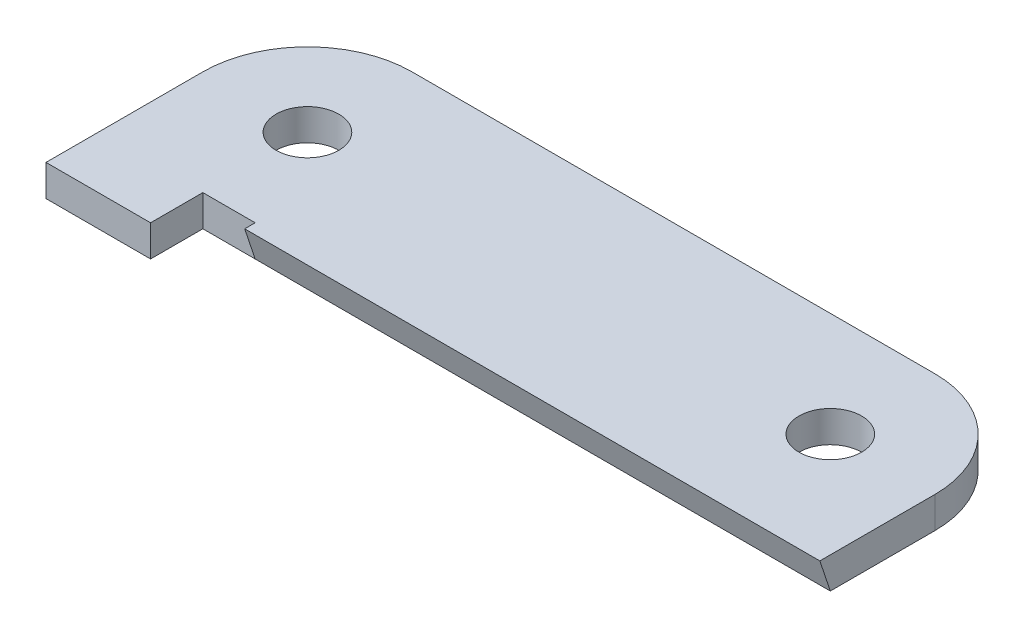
ISO-10303-21;
HEADER;
FILE_DESCRIPTION(('STEP AP214'),'2;1');
FILE_NAME('part.step','',(''),(''),'','','');
FILE_SCHEMA(('AUTOMOTIVE_DESIGN { 1 0 10303 214 1 1 1 1 }'));
ENDSEC;
DATA;
#1=APPLICATION_CONTEXT('core data for automotive mechanical design processes');
#2=APPLICATION_PROTOCOL_DEFINITION('international standard','automotive_design',2000,#1);
#3=PRODUCT_CONTEXT('',#1,'mechanical');
#4=PRODUCT('Part','Part','',(#3));
#5=PRODUCT_RELATED_PRODUCT_CATEGORY('part','',(#4));
#6=PRODUCT_DEFINITION_FORMATION('','',#4);
#7=PRODUCT_DEFINITION_CONTEXT('part definition',#1,'design');
#8=PRODUCT_DEFINITION('design','',#6,#7);
#9=PRODUCT_DEFINITION_SHAPE('','',#8);
#10=(LENGTH_UNIT() NAMED_UNIT(*) SI_UNIT(.MILLI.,.METRE.));
#11=(NAMED_UNIT(*) PLANE_ANGLE_UNIT() SI_UNIT($,.RADIAN.));
#12=(NAMED_UNIT(*) SI_UNIT($,.STERADIAN.) SOLID_ANGLE_UNIT());
#13=UNCERTAINTY_MEASURE_WITH_UNIT(LENGTH_MEASURE(1.E-05),#10,'distance_accuracy_value','');
#14=(GEOMETRIC_REPRESENTATION_CONTEXT(3) GLOBAL_UNCERTAINTY_ASSIGNED_CONTEXT((#13)) GLOBAL_UNIT_ASSIGNED_CONTEXT((#10,
#11,#12)) REPRESENTATION_CONTEXT('',''));
#15=CARTESIAN_POINT('',(0.,0.,0.));
#16=DIRECTION('',(0.,0.,1.));
#17=DIRECTION('',(1.,0.,0.));
#18=AXIS2_PLACEMENT_3D('',#15,#16,#17);
#19=CARTESIAN_POINT('',(10.,3.,-15.));
#20=DIRECTION('',(0.,-1.,0.));
#21=DIRECTION('',(0.,0.,-1.));
#22=AXIS2_PLACEMENT_3D('',#19,#20,#21);
#23=PLANE('',#22);
#24=CARTESIAN_POINT('',(10.,3.,-15.));
#25=DIRECTION('',(0.,1.,0.));
#26=DIRECTION('',(0.,0.,1.));
#27=AXIS2_PLACEMENT_3D('',#24,#25,#26);
#28=CIRCLE('',#27,3.);
#29=CARTESIAN_POINT('',(10.,3.,-12.));
#30=VERTEX_POINT('',#29);
#31=EDGE_CURVE('E202',#30,#30,#28,.T.);
#32=ORIENTED_EDGE('',*,*,#31,.F.);
#33=EDGE_LOOP('',(#32));
#34=FACE_BOUND('',#33,.T.);
#35=DIRECTION('',(0.,0.,1.));
#36=VECTOR('',#35,1.);
#37=CARTESIAN_POINT('',(0.,3.,0.));
#38=LINE('',#37,#36);
#39=CARTESIAN_POINT('',(0.,3.,-14.9999999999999));
#40=VERTEX_POINT('',#39);
#41=CARTESIAN_POINT('',(0.,3.,0.));
#42=VERTEX_POINT('',#41);
#43=EDGE_CURVE('E178',#40,#42,#38,.T.);
#44=ORIENTED_EDGE('',*,*,#43,.T.);
#45=DIRECTION('',(1.,0.,0.));
#46=VECTOR('',#45,1.);
#47=CARTESIAN_POINT('',(0.,3.,0.));
#48=LINE('',#47,#46);
#49=CARTESIAN_POINT('',(10.,3.,0.));
#50=VERTEX_POINT('',#49);
#51=EDGE_CURVE('E180',#42,#50,#48,.T.);
#52=ORIENTED_EDGE('',*,*,#51,.T.);
#53=DIRECTION('',(0.,0.,-1.));
#54=VECTOR('',#53,1.);
#55=CARTESIAN_POINT('',(10.,3.,0.));
#56=LINE('',#55,#54);
#57=CARTESIAN_POINT('',(10.,3.,-5.));
#58=VERTEX_POINT('',#57);
#59=EDGE_CURVE('E154',#50,#58,#56,.T.);
#60=ORIENTED_EDGE('',*,*,#59,.T.);
#61=DIRECTION('',(1.,0.,0.));
#62=VECTOR('',#61,1.);
#63=CARTESIAN_POINT('',(10.,3.,-5.));
#64=LINE('',#63,#62);
#65=CARTESIAN_POINT('',(15.,3.,-5.));
#66=VERTEX_POINT('',#65);
#67=EDGE_CURVE('E183',#58,#66,#64,.T.);
#68=ORIENTED_EDGE('',*,*,#67,.T.);
#69=DIRECTION('',(0.,0.,1.));
#70=VECTOR('',#69,1.);
#71=CARTESIAN_POINT('',(15.,3.,-4.));
#72=LINE('',#71,#70);
#73=CARTESIAN_POINT('',(15.,3.,-4.));
#74=VERTEX_POINT('',#73);
#75=EDGE_CURVE('E117',#66,#74,#72,.T.);
#76=ORIENTED_EDGE('',*,*,#75,.T.);
#77=DIRECTION('',(1.,0.,0.));
#78=VECTOR('',#77,1.);
#79=CARTESIAN_POINT('',(15.,3.,-4.));
#80=LINE('',#79,#78);
#81=CARTESIAN_POINT('',(70.,3.,-4.));
#82=VERTEX_POINT('',#81);
#83=EDGE_CURVE('E105',#74,#82,#80,.T.);
#84=ORIENTED_EDGE('',*,*,#83,.T.);
#85=DIRECTION('',(0.,0.,-1.));
#86=VECTOR('',#85,1.);
#87=CARTESIAN_POINT('',(70.,3.,-4.));
#88=LINE('',#87,#86);
#89=CARTESIAN_POINT('',(70.,3.,-14.9999999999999));
#90=VERTEX_POINT('',#89);
#91=EDGE_CURVE('E114',#82,#90,#88,.T.);
#92=ORIENTED_EDGE('',*,*,#91,.T.);
#93=CARTESIAN_POINT('',(60.,3.,-15.));
#94=DIRECTION('',(0.,1.,0.));
#95=DIRECTION('',(0.,0.,1.));
#96=AXIS2_PLACEMENT_3D('',#93,#94,#95);
#97=CIRCLE('',#96,10.);
#98=CARTESIAN_POINT('',(59.9999999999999,3.,-25.));
#99=VERTEX_POINT('',#98);
#100=EDGE_CURVE('E123',#90,#99,#97,.T.);
#101=ORIENTED_EDGE('',*,*,#100,.T.);
#102=DIRECTION('',(-1.,0.,0.));
#103=VECTOR('',#102,1.);
#104=CARTESIAN_POINT('',(10.0000000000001,3.,-25.));
#105=LINE('',#104,#103);
#106=CARTESIAN_POINT('',(10.0000000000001,3.,-25.));
#107=VERTEX_POINT('',#106);
#108=EDGE_CURVE('E125',#99,#107,#105,.T.);
#109=ORIENTED_EDGE('',*,*,#108,.T.);
#110=CARTESIAN_POINT('',(10.,3.,-15.));
#111=DIRECTION('',(0.,1.,0.));
#112=DIRECTION('',(0.,0.,-1.));
#113=AXIS2_PLACEMENT_3D('',#110,#111,#112);
#114=CIRCLE('',#113,10.);
#115=EDGE_CURVE('E53',#107,#40,#114,.T.);
#116=ORIENTED_EDGE('',*,*,#115,.T.);
#117=EDGE_LOOP('',(#44,#52,#60,#68,#76,#84,#92,#101,#109,#116));
#118=FACE_BOUND('',#117,.T.);
#119=CARTESIAN_POINT('',(60.,3.,-15.));
#120=DIRECTION('',(0.,1.,0.));
#121=DIRECTION('',(0.,0.,1.));
#122=AXIS2_PLACEMENT_3D('',#119,#120,#121);
#123=CIRCLE('',#122,3.00000000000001);
#124=CARTESIAN_POINT('',(60.,3.,-12.));
#125=VERTEX_POINT('',#124);
#126=EDGE_CURVE('E196',#125,#125,#123,.T.);
#127=ORIENTED_EDGE('',*,*,#126,.F.);
#128=EDGE_LOOP('',(#127));
#129=FACE_BOUND('',#128,.T.);
#130=ADVANCED_FACE('F30',(#34,#118,#129),#23,.F.);
#131=CARTESIAN_POINT('',(10.,0.,-15.));
#132=DIRECTION('',(0.,-1.,0.));
#133=DIRECTION('',(0.,0.,-1.));
#134=AXIS2_PLACEMENT_3D('',#131,#132,#133);
#135=PLANE('',#134);
#136=DIRECTION('',(1.,0.,0.));
#137=VECTOR('',#136,1.);
#138=CARTESIAN_POINT('',(15.,0.,-5.));
#139=LINE('',#138,#137);
#140=CARTESIAN_POINT('',(15.,0.,-5.));
#141=VERTEX_POINT('',#140);
#142=CARTESIAN_POINT('',(70.,0.,-5.));
#143=VERTEX_POINT('',#142);
#144=EDGE_CURVE('E45',#141,#143,#139,.T.);
#145=ORIENTED_EDGE('',*,*,#144,.F.);
#146=DIRECTION('',(1.,0.,0.));
#147=VECTOR('',#146,1.);
#148=CARTESIAN_POINT('',(10.,0.,-5.));
#149=LINE('',#148,#147);
#150=CARTESIAN_POINT('',(10.,0.,-5.));
#151=VERTEX_POINT('',#150);
#152=EDGE_CURVE('E163',#151,#141,#149,.T.);
#153=ORIENTED_EDGE('',*,*,#152,.F.);
#154=DIRECTION('',(0.,0.,-1.));
#155=VECTOR('',#154,1.);
#156=CARTESIAN_POINT('',(10.,0.,0.));
#157=LINE('',#156,#155);
#158=CARTESIAN_POINT('',(10.,0.,0.));
#159=VERTEX_POINT('',#158);
#160=EDGE_CURVE('E153',#159,#151,#157,.T.);
#161=ORIENTED_EDGE('',*,*,#160,.F.);
#162=DIRECTION('',(1.,0.,0.));
#163=VECTOR('',#162,1.);
#164=CARTESIAN_POINT('',(0.,0.,0.));
#165=LINE('',#164,#163);
#166=CARTESIAN_POINT('',(0.,0.,0.));
#167=VERTEX_POINT('',#166);
#168=EDGE_CURVE('E161',#167,#159,#165,.T.);
#169=ORIENTED_EDGE('',*,*,#168,.F.);
#170=DIRECTION('',(0.,0.,1.));
#171=VECTOR('',#170,1.);
#172=CARTESIAN_POINT('',(0.,0.,0.));
#173=LINE('',#172,#171);
#174=CARTESIAN_POINT('',(0.,0.,-14.9999999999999));
#175=VERTEX_POINT('',#174);
#176=EDGE_CURVE('E167',#175,#167,#173,.T.);
#177=ORIENTED_EDGE('',*,*,#176,.F.);
#178=CARTESIAN_POINT('',(10.,0.,-15.));
#179=DIRECTION('',(0.,1.,0.));
#180=DIRECTION('',(0.,0.,-1.));
#181=AXIS2_PLACEMENT_3D('',#178,#179,#180);
#182=CIRCLE('',#181,10.);
#183=CARTESIAN_POINT('',(10.0000000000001,0.,-25.));
#184=VERTEX_POINT('',#183);
#185=EDGE_CURVE('E176',#184,#175,#182,.T.);
#186=ORIENTED_EDGE('',*,*,#185,.F.);
#187=DIRECTION('',(-1.,0.,0.));
#188=VECTOR('',#187,1.);
#189=CARTESIAN_POINT('',(10.0000000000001,0.,-25.));
#190=LINE('',#189,#188);
#191=CARTESIAN_POINT('',(59.9999999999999,0.,-25.));
#192=VERTEX_POINT('',#191);
#193=EDGE_CURVE('E174',#192,#184,#190,.T.);
#194=ORIENTED_EDGE('',*,*,#193,.F.);
#195=CARTESIAN_POINT('',(60.,0.,-15.));
#196=DIRECTION('',(0.,1.,0.));
#197=DIRECTION('',(0.,0.,1.));
#198=AXIS2_PLACEMENT_3D('',#195,#196,#197);
#199=CIRCLE('',#198,10.);
#200=CARTESIAN_POINT('',(70.,0.,-14.9999999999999));
#201=VERTEX_POINT('',#200);
#202=EDGE_CURVE('E172',#201,#192,#199,.T.);
#203=ORIENTED_EDGE('',*,*,#202,.F.);
#204=DIRECTION('',(0.,0.,-1.));
#205=VECTOR('',#204,1.);
#206=CARTESIAN_POINT('',(70.,0.,-4.));
#207=LINE('',#206,#205);
#208=EDGE_CURVE('E165',#143,#201,#207,.T.);
#209=ORIENTED_EDGE('',*,*,#208,.F.);
#210=EDGE_LOOP('',(#145,#153,#161,#169,#177,#186,#194,#203,#209));
#211=FACE_BOUND('',#210,.T.);
#212=CARTESIAN_POINT('',(10.,0.,-15.));
#213=DIRECTION('',(0.,1.,0.));
#214=DIRECTION('',(0.,0.,1.));
#215=AXIS2_PLACEMENT_3D('',#212,#213,#214);
#216=CIRCLE('',#215,3.);
#217=CARTESIAN_POINT('',(10.,0.,-12.));
#218=VERTEX_POINT('',#217);
#219=EDGE_CURVE('E199',#218,#218,#216,.T.);
#220=ORIENTED_EDGE('',*,*,#219,.T.);
#221=EDGE_LOOP('',(#220));
#222=FACE_BOUND('',#221,.T.);
#223=CARTESIAN_POINT('',(60.,0.,-15.));
#224=DIRECTION('',(0.,1.,0.));
#225=DIRECTION('',(0.,0.,1.));
#226=AXIS2_PLACEMENT_3D('',#223,#224,#225);
#227=CIRCLE('',#226,3.00000000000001);
#228=CARTESIAN_POINT('',(60.,0.,-12.));
#229=VERTEX_POINT('',#228);
#230=EDGE_CURVE('E191',#229,#229,#227,.T.);
#231=ORIENTED_EDGE('',*,*,#230,.T.);
#232=EDGE_LOOP('',(#231));
#233=FACE_BOUND('',#232,.T.);
#234=ADVANCED_FACE('F158',(#211,#222,#233),#135,.T.);
#235=CARTESIAN_POINT('',(0.,3.,0.));
#236=DIRECTION('',(1.,0.,0.));
#237=DIRECTION('',(0.,0.,-1.));
#238=AXIS2_PLACEMENT_3D('',#235,#236,#237);
#239=PLANE('',#238);
#240=ORIENTED_EDGE('',*,*,#176,.T.);
#241=DIRECTION('',(0.,-1.,0.));
#242=VECTOR('',#241,1.);
#243=CARTESIAN_POINT('',(0.,3.,0.));
#244=LINE('',#243,#242);
#245=EDGE_CURVE('E11',#42,#167,#244,.T.);
#246=ORIENTED_EDGE('',*,*,#245,.F.);
#247=ORIENTED_EDGE('',*,*,#43,.F.);
#248=DIRECTION('',(0.,-1.,0.));
#249=VECTOR('',#248,1.);
#250=CARTESIAN_POINT('',(0.,3.,-14.9999999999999));
#251=LINE('',#250,#249);
#252=EDGE_CURVE('E131',#40,#175,#251,.T.);
#253=ORIENTED_EDGE('',*,*,#252,.T.);
#254=EDGE_LOOP('',(#240,#246,#247,#253));
#255=FACE_BOUND('',#254,.T.);
#256=ADVANCED_FACE('F32',(#255),#239,.F.);
#257=CARTESIAN_POINT('',(0.,3.,0.));
#258=DIRECTION('',(0.,0.,-1.));
#259=DIRECTION('',(-1.,0.,0.));
#260=AXIS2_PLACEMENT_3D('',#257,#258,#259);
#261=PLANE('',#260);
#262=ORIENTED_EDGE('',*,*,#168,.T.);
#263=DIRECTION('',(0.,-1.,0.));
#264=VECTOR('',#263,1.);
#265=CARTESIAN_POINT('',(10.,3.,0.));
#266=LINE('',#265,#264);
#267=EDGE_CURVE('E38',#50,#159,#266,.T.);
#268=ORIENTED_EDGE('',*,*,#267,.F.);
#269=ORIENTED_EDGE('',*,*,#51,.F.);
#270=ORIENTED_EDGE('',*,*,#245,.T.);
#271=EDGE_LOOP('',(#262,#268,#269,#270));
#272=FACE_BOUND('',#271,.T.);
#273=ADVANCED_FACE('F320',(#272),#261,.F.);
#274=CARTESIAN_POINT('',(10.,3.,0.));
#275=DIRECTION('',(-1.,0.,0.));
#276=DIRECTION('',(0.,0.,1.));
#277=AXIS2_PLACEMENT_3D('',#274,#275,#276);
#278=PLANE('',#277);
#279=ORIENTED_EDGE('',*,*,#160,.T.);
#280=DIRECTION('',(0.,-1.,0.));
#281=VECTOR('',#280,1.);
#282=CARTESIAN_POINT('',(10.,3.,-5.));
#283=LINE('',#282,#281);
#284=EDGE_CURVE('E144',#58,#151,#283,.T.);
#285=ORIENTED_EDGE('',*,*,#284,.F.);
#286=ORIENTED_EDGE('',*,*,#59,.F.);
#287=ORIENTED_EDGE('',*,*,#267,.T.);
#288=EDGE_LOOP('',(#279,#285,#286,#287));
#289=FACE_BOUND('',#288,.T.);
#290=ADVANCED_FACE('F151',(#289),#278,.F.);
#291=CARTESIAN_POINT('',(10.,3.,-5.));
#292=DIRECTION('',(0.,0.,-1.));
#293=DIRECTION('',(-1.,0.,0.));
#294=AXIS2_PLACEMENT_3D('',#291,#292,#293);
#295=PLANE('',#294);
#296=ORIENTED_EDGE('',*,*,#152,.T.);
#297=DIRECTION('',(0.,-1.,0.));
#298=VECTOR('',#297,1.);
#299=CARTESIAN_POINT('',(15.,3.,-5.));
#300=LINE('',#299,#298);
#301=EDGE_CURVE('E141',#66,#141,#300,.T.);
#302=ORIENTED_EDGE('',*,*,#301,.F.);
#303=ORIENTED_EDGE('',*,*,#67,.F.);
#304=ORIENTED_EDGE('',*,*,#284,.T.);
#305=EDGE_LOOP('',(#296,#302,#303,#304));
#306=FACE_BOUND('',#305,.T.);
#307=ADVANCED_FACE('F187',(#306),#295,.F.);
#308=CARTESIAN_POINT('',(15.,3.,-4.));
#309=DIRECTION('',(1.,0.,0.));
#310=DIRECTION('',(0.,0.,-1.));
#311=AXIS2_PLACEMENT_3D('',#308,#309,#310);
#312=PLANE('',#311);
#313=ORIENTED_EDGE('',*,*,#301,.T.);
#314=DIRECTION('',(0.,0.948683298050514,0.316227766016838));
#315=VECTOR('',#314,1.);
#316=CARTESIAN_POINT('',(15.,0.,-5.));
#317=LINE('',#316,#315);
#318=EDGE_CURVE('E110',#141,#74,#317,.T.);
#319=ORIENTED_EDGE('',*,*,#318,.T.);
#320=ORIENTED_EDGE('',*,*,#75,.F.);
#321=EDGE_LOOP('',(#313,#319,#320));
#322=FACE_BOUND('',#321,.T.);
#323=ADVANCED_FACE('F189',(#322),#312,.F.);
#324=CARTESIAN_POINT('',(70.,3.,-4.));
#325=DIRECTION('',(-1.,0.,0.));
#326=DIRECTION('',(0.,0.,1.));
#327=AXIS2_PLACEMENT_3D('',#324,#325,#326);
#328=PLANE('',#327);
#329=ORIENTED_EDGE('',*,*,#91,.F.);
#330=DIRECTION('',(0.,0.948683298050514,0.316227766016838));
#331=VECTOR('',#330,1.);
#332=CARTESIAN_POINT('',(70.,0.,-5.));
#333=LINE('',#332,#331);
#334=EDGE_CURVE('E102',#143,#82,#333,.T.);
#335=ORIENTED_EDGE('',*,*,#334,.F.);
#336=ORIENTED_EDGE('',*,*,#208,.T.);
#337=DIRECTION('',(0.,-1.,0.));
#338=VECTOR('',#337,1.);
#339=CARTESIAN_POINT('',(70.,3.,-14.9999999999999));
#340=LINE('',#339,#338);
#341=EDGE_CURVE('E121',#90,#201,#340,.T.);
#342=ORIENTED_EDGE('',*,*,#341,.F.);
#343=EDGE_LOOP('',(#329,#335,#336,#342));
#344=FACE_BOUND('',#343,.T.);
#345=ADVANCED_FACE('F119',(#344),#328,.F.);
#346=CARTESIAN_POINT('',(60.,3.,-15.));
#347=DIRECTION('',(0.,-1.,0.));
#348=DIRECTION('',(0.,0.,-1.));
#349=AXIS2_PLACEMENT_3D('',#346,#347,#348);
#350=CYLINDRICAL_SURFACE('',#349,10.);
#351=ORIENTED_EDGE('',*,*,#202,.T.);
#352=DIRECTION('',(0.,-1.,0.));
#353=VECTOR('',#352,1.);
#354=CARTESIAN_POINT('',(59.9999999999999,3.,-25.));
#355=LINE('',#354,#353);
#356=EDGE_CURVE('E137',#99,#192,#355,.T.);
#357=ORIENTED_EDGE('',*,*,#356,.F.);
#358=ORIENTED_EDGE('',*,*,#100,.F.);
#359=ORIENTED_EDGE('',*,*,#341,.T.);
#360=EDGE_LOOP('',(#351,#357,#358,#359));
#361=FACE_BOUND('',#360,.T.);
#362=ADVANCED_FACE('F219',(#361),#350,.T.);
#363=CARTESIAN_POINT('',(10.0000000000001,3.,-25.));
#364=DIRECTION('',(0.,0.,1.));
#365=DIRECTION('',(1.,0.,0.));
#366=AXIS2_PLACEMENT_3D('',#363,#364,#365);
#367=PLANE('',#366);
#368=ORIENTED_EDGE('',*,*,#193,.T.);
#369=DIRECTION('',(0.,-1.,0.));
#370=VECTOR('',#369,1.);
#371=CARTESIAN_POINT('',(10.0000000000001,3.,-25.));
#372=LINE('',#371,#370);
#373=EDGE_CURVE('E134',#107,#184,#372,.T.);
#374=ORIENTED_EDGE('',*,*,#373,.F.);
#375=ORIENTED_EDGE('',*,*,#108,.F.);
#376=ORIENTED_EDGE('',*,*,#356,.T.);
#377=EDGE_LOOP('',(#368,#374,#375,#376));
#378=FACE_BOUND('',#377,.T.);
#379=ADVANCED_FACE('F216',(#378),#367,.F.);
#380=CARTESIAN_POINT('',(10.,3.,-15.));
#381=DIRECTION('',(0.,-1.,0.));
#382=DIRECTION('',(0.,0.,-1.));
#383=AXIS2_PLACEMENT_3D('',#380,#381,#382);
#384=CYLINDRICAL_SURFACE('',#383,10.);
#385=ORIENTED_EDGE('',*,*,#185,.T.);
#386=ORIENTED_EDGE('',*,*,#252,.F.);
#387=ORIENTED_EDGE('',*,*,#115,.F.);
#388=ORIENTED_EDGE('',*,*,#373,.T.);
#389=EDGE_LOOP('',(#385,#386,#387,#388));
#390=FACE_BOUND('',#389,.T.);
#391=ADVANCED_FACE('F212',(#390),#384,.T.);
#392=CARTESIAN_POINT('',(10.,3.,-15.));
#393=DIRECTION('',(0.,-1.,0.));
#394=DIRECTION('',(0.,0.,-1.));
#395=AXIS2_PLACEMENT_3D('',#392,#393,#394);
#396=CYLINDRICAL_SURFACE('',#395,3.);
#397=ORIENTED_EDGE('',*,*,#31,.T.);
#398=EDGE_LOOP('',(#397));
#399=FACE_BOUND('',#398,.T.);
#400=ORIENTED_EDGE('',*,*,#219,.F.);
#401=EDGE_LOOP('',(#400));
#402=FACE_BOUND('',#401,.T.);
#403=ADVANCED_FACE('F239',(#399,#402),#396,.F.);
#404=CARTESIAN_POINT('',(60.,3.,-15.));
#405=DIRECTION('',(0.,-1.,0.));
#406=DIRECTION('',(0.,0.,-1.));
#407=AXIS2_PLACEMENT_3D('',#404,#405,#406);
#408=CYLINDRICAL_SURFACE('',#407,3.00000000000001);
#409=ORIENTED_EDGE('',*,*,#126,.T.);
#410=EDGE_LOOP('',(#409));
#411=FACE_BOUND('',#410,.T.);
#412=ORIENTED_EDGE('',*,*,#230,.F.);
#413=EDGE_LOOP('',(#412));
#414=FACE_BOUND('',#413,.T.);
#415=ADVANCED_FACE('F243',(#411,#414),#408,.F.);
#416=CARTESIAN_POINT('',(15.,0.,-5.));
#417=DIRECTION('',(0.,0.316227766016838,-0.948683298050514));
#418=DIRECTION('',(0.,0.948683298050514,0.316227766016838));
#419=AXIS2_PLACEMENT_3D('',#416,#417,#418);
#420=PLANE('',#419);
#421=ORIENTED_EDGE('',*,*,#334,.T.);
#422=ORIENTED_EDGE('',*,*,#83,.F.);
#423=ORIENTED_EDGE('',*,*,#318,.F.);
#424=ORIENTED_EDGE('',*,*,#144,.T.);
#425=EDGE_LOOP('',(#421,#422,#423,#424));
#426=FACE_BOUND('',#425,.T.);
#427=ADVANCED_FACE('F104',(#426),#420,.F.);
#428=CLOSED_SHELL('',(#130,#234,#256,#273,#290,#307,#323,#345,#362,#379,#391,#403,#415,#427));
#429=MANIFOLD_SOLID_BREP('B2',#428);
#430=ADVANCED_BREP_SHAPE_REPRESENTATION('',(#18,#429),#14);
#431=SHAPE_DEFINITION_REPRESENTATION(#9,#430);
ENDSEC;
END-ISO-10303-21;
